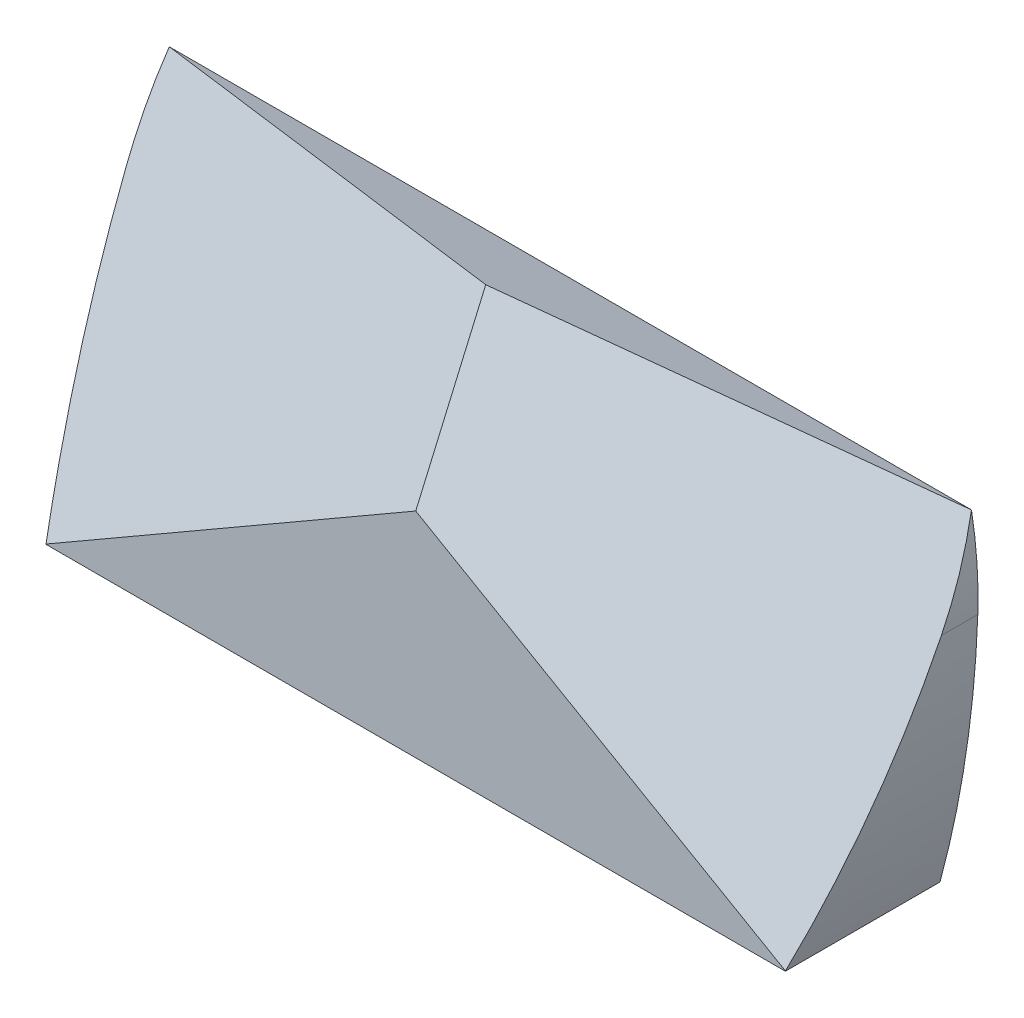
from build123d import *

# Parameters (mm, degrees)
LINEAR_AUSTRAGEN1_DEPTH = 9
SKIZZE53_W              = 38.78647041
SKIZZE53_H              = 12.352702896
LINEAR_AUSTRAGEN2_DEPTH = 4
SKIZZE54_W              = 36.136369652
SKIZZE54_H              = 36.520589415
LINEAR_AUSTRAGEN3_DEPTH = 91.414900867
SKIZZE56_W              = 83.648063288
SKIZZE56_H              = 26.68465228
LINEAR_AUSTRAGEN6_DEPTH = 95.096681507
SKIZZE55_W              = 44.472540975
SKIZZE55_H              = 43.884107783
LINEAR_AUSTRAGEN7_DEPTH = 4
SKIZZE57_W              = 45.448019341
SKIZZE57_H              = 46.209626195
LINEAR_AUSTRAGEN8_DEPTH = 4


with BuildPart() as part:
    # Skizze35 → Linear austragen1 (new body)
    with BuildSketch(Plane.XY.offset(-107.7276)):
        with BuildLine():
            Line((-16.275923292, 23.2381), (16.275923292, 23.2381))
            ThreePointArc((16.275923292, 23.2381), (17.421230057, 28.705900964), (17.938471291, 34.268367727))
            ThreePointArc((17.938471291, 34.268367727), (17.903674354, 36.200376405), (17.661399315, 38.11745))
            Line((17.661399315, 38.11745), (-17.661399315, 38.11745))
            ThreePointArc((-17.661399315, 38.11745), (-17.903674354, 36.200376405), (-17.938471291, 34.268367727))
            ThreePointArc((-17.938471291, 34.268367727), (-17.421230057, 28.705900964), (-16.275923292, 23.2381))
        make_face()
    extrude(amount=LINEAR_AUSTRAGEN1_DEPTH)

    # Skizze53 → Linear austragen2 (add)
    with BuildSketch(Plane(origin=(0, 38.11745, 0), x_dir=(-1, 0, 0), z_dir=(0, 1, 0))):
        with Locations((-0.152634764, -103.293192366)):
            Rectangle(SKIZZE53_W, SKIZZE53_H)
    extrude(amount=LINEAR_AUSTRAGEN2_DEPTH)

    # Skizze54 → Linear austragen3 (cut, through all)
    with BuildSketch(Plane(origin=(17.38592424, -30.11330412, -69.269168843), x_dir=(-0.9745167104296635, -0.08943090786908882, -0.205716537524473), z_dir=(0.22431491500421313, -0.388524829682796, -0.8937176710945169))):
        with Locations((25.354834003, 69.222948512)):
            Rectangle(SKIZZE54_W, SKIZZE54_H)
    extrude(amount=-LINEAR_AUSTRAGEN3_DEPTH, mode=Mode.SUBTRACT)

    # Skizze56 → Linear austragen6 (cut, through all)
    with BuildSketch(Plane(origin=(0, 71.447029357, -31.060082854), x_dir=(1, 0, 0), z_dir=(0, -0.9170880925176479, 0.3986846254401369))):
        with Locations((0.195885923, -76.51059786)):
            Rectangle(SKIZZE56_W, SKIZZE56_H)
    extrude(amount=-LINEAR_AUSTRAGEN6_DEPTH, mode=Mode.SUBTRACT)

    # Skizze55 → Linear austragen7 (cut)
    with BuildSketch(Plane(origin=(-17.38592424, -30.11330412, -69.269168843), x_dir=(0.9745167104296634, -0.0894309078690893, -0.20571653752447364), z_dir=(0.2243149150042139, 0.3885248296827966, 0.8937176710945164))):
        with Locations((31.012887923, 70.689858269)):
            Rectangle(SKIZZE55_W, SKIZZE55_H)
    extrude(amount=LINEAR_AUSTRAGEN7_DEPTH, mode=Mode.SUBTRACT)


with BuildPart() as body_2:
    # of the pieces the cut leaves, the one that is kept (linear_austragen7_keep)
    add(part.part.solids().sort_by_distance((-16.275923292, 23.2381, -107.7276))[0])

    # Skizze57 → Linear austragen8 (cut)
    with BuildSketch(Plane.XY.offset(-100.917757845)):
        with Locations((3.345128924, 31.432987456)):
            Rectangle(SKIZZE57_W, SKIZZE57_H)
    extrude(amount=LINEAR_AUSTRAGEN8_DEPTH, mode=Mode.SUBTRACT)


solid = body_2.part
